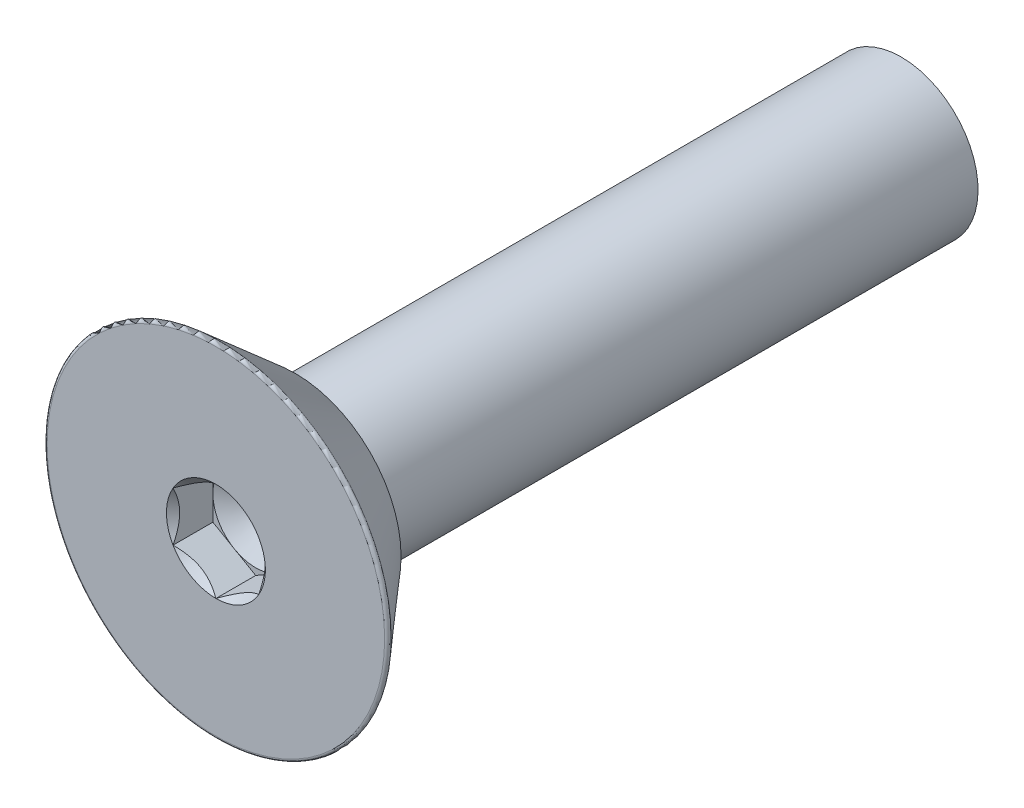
ISO-10303-21;
HEADER;
FILE_DESCRIPTION(('STEP AP214'),'2;1');
FILE_NAME('part.step','',(''),(''),'','','');
FILE_SCHEMA(('AUTOMOTIVE_DESIGN { 1 0 10303 214 1 1 1 1 }'));
ENDSEC;
DATA;
#1=APPLICATION_CONTEXT('core data for automotive mechanical design processes');
#2=APPLICATION_PROTOCOL_DEFINITION('international standard','automotive_design',2000,#1);
#3=PRODUCT_CONTEXT('',#1,'mechanical');
#4=PRODUCT('Part','Part','',(#3));
#5=PRODUCT_RELATED_PRODUCT_CATEGORY('part','',(#4));
#6=PRODUCT_DEFINITION_FORMATION('','',#4);
#7=PRODUCT_DEFINITION_CONTEXT('part definition',#1,'design');
#8=PRODUCT_DEFINITION('design','',#6,#7);
#9=PRODUCT_DEFINITION_SHAPE('','',#8);
#10=(LENGTH_UNIT() NAMED_UNIT(*) SI_UNIT(.MILLI.,.METRE.));
#11=(NAMED_UNIT(*) PLANE_ANGLE_UNIT() SI_UNIT($,.RADIAN.));
#12=(NAMED_UNIT(*) SI_UNIT($,.STERADIAN.) SOLID_ANGLE_UNIT());
#13=UNCERTAINTY_MEASURE_WITH_UNIT(LENGTH_MEASURE(1.E-05),#10,'distance_accuracy_value','');
#14=(GEOMETRIC_REPRESENTATION_CONTEXT(3) GLOBAL_UNCERTAINTY_ASSIGNED_CONTEXT((#13)) GLOBAL_UNIT_ASSIGNED_CONTEXT((#10,
#11,#12)) REPRESENTATION_CONTEXT('',''));
#15=CARTESIAN_POINT('',(0.,0.,0.));
#16=DIRECTION('',(0.,0.,1.));
#17=DIRECTION('',(1.,0.,0.));
#18=AXIS2_PLACEMENT_3D('',#15,#16,#17);
#19=CARTESIAN_POINT('',(0.,-0.916543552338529,0.73787));
#20=DIRECTION('',(0.,0.,1.));
#21=DIRECTION('',(1.,0.,0.));
#22=AXIS2_PLACEMENT_3D('',#19,#20,#21);
#23=PLANE('',#22);
#24=CARTESIAN_POINT('',(0.,0.,0.73787));
#25=DIRECTION('',(0.,0.,1.));
#26=DIRECTION('',(1.,0.,0.));
#27=AXIS2_PLACEMENT_3D('',#24,#25,#26);
#28=CIRCLE('',#27,0.79375);
#29=CARTESIAN_POINT('',(0.79375,0.,0.73787));
#30=VERTEX_POINT('',#29);
#31=CARTESIAN_POINT('',(0.396875,0.687407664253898,0.73787));
#32=VERTEX_POINT('',#31);
#33=EDGE_CURVE('E45',#30,#32,#28,.T.);
#34=ORIENTED_EDGE('',*,*,#33,.F.);
#35=DIRECTION('',(0.,1.,0.));
#36=VECTOR('',#35,1.);
#37=CARTESIAN_POINT('',(0.79375,-0.458271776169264,0.73787));
#38=LINE('',#37,#36);
#39=CARTESIAN_POINT('',(0.79375,0.458271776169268,0.73787));
#40=VERTEX_POINT('',#39);
#41=EDGE_CURVE('E115',#30,#40,#38,.T.);
#42=ORIENTED_EDGE('',*,*,#41,.T.);
#43=DIRECTION('',(-0.866025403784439,0.5,0.));
#44=VECTOR('',#43,1.);
#45=CARTESIAN_POINT('',(0.79375,0.458271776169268,0.73787));
#46=LINE('',#45,#44);
#47=EDGE_CURVE('E118',#40,#32,#46,.T.);
#48=ORIENTED_EDGE('',*,*,#47,.T.);
#49=EDGE_LOOP('',(#34,#42,#48));
#50=FACE_BOUND('',#49,.T.);
#51=ADVANCED_FACE('F34',(#50),#23,.T.);
#52=CARTESIAN_POINT('',(-0.396875,0.687407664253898,0.73787));
#53=VERTEX_POINT('',#52);
#54=EDGE_CURVE('E11',#32,#53,#28,.T.);
#55=ORIENTED_EDGE('',*,*,#54,.F.);
#56=CARTESIAN_POINT('',(0.,0.916543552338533,0.73787));
#57=VERTEX_POINT('',#56);
#58=EDGE_CURVE('E132',#32,#57,#46,.T.);
#59=ORIENTED_EDGE('',*,*,#58,.T.);
#60=DIRECTION('',(-0.866025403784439,-0.5,0.));
#61=VECTOR('',#60,1.);
#62=CARTESIAN_POINT('',(0.,0.916543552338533,0.73787));
#63=LINE('',#62,#61);
#64=EDGE_CURVE('E138',#57,#53,#63,.T.);
#65=ORIENTED_EDGE('',*,*,#64,.T.);
#66=EDGE_LOOP('',(#55,#59,#65));
#67=FACE_BOUND('',#66,.T.);
#68=ADVANCED_FACE('F192',(#67),#23,.T.);
#69=CARTESIAN_POINT('',(-0.79375,0.,0.73787));
#70=VERTEX_POINT('',#69);
#71=EDGE_CURVE('E43',#53,#70,#28,.T.);
#72=ORIENTED_EDGE('',*,*,#71,.F.);
#73=CARTESIAN_POINT('',(-0.79375,0.458271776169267,0.73787));
#74=VERTEX_POINT('',#73);
#75=EDGE_CURVE('E137',#53,#74,#63,.T.);
#76=ORIENTED_EDGE('',*,*,#75,.T.);
#77=DIRECTION('',(0.,-1.,0.));
#78=VECTOR('',#77,1.);
#79=CARTESIAN_POINT('',(-0.79375,0.458271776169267,0.73787));
#80=LINE('',#79,#78);
#81=EDGE_CURVE('E142',#74,#70,#80,.T.);
#82=ORIENTED_EDGE('',*,*,#81,.T.);
#83=EDGE_LOOP('',(#72,#76,#82));
#84=FACE_BOUND('',#83,.T.);
#85=ADVANCED_FACE('F197',(#84),#23,.T.);
#86=CARTESIAN_POINT('',(-0.396875,-0.687407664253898,0.73787));
#87=VERTEX_POINT('',#86);
#88=EDGE_CURVE('E227',#70,#87,#28,.T.);
#89=ORIENTED_EDGE('',*,*,#88,.F.);
#90=CARTESIAN_POINT('',(-0.79375,-0.458271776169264,0.73787));
#91=VERTEX_POINT('',#90);
#92=EDGE_CURVE('E141',#70,#91,#80,.T.);
#93=ORIENTED_EDGE('',*,*,#92,.T.);
#94=DIRECTION('',(0.866025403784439,-0.5,0.));
#95=VECTOR('',#94,1.);
#96=CARTESIAN_POINT('',(-0.79375,-0.458271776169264,0.73787));
#97=LINE('',#96,#95);
#98=EDGE_CURVE('E232',#91,#87,#97,.T.);
#99=ORIENTED_EDGE('',*,*,#98,.T.);
#100=EDGE_LOOP('',(#89,#93,#99));
#101=FACE_BOUND('',#100,.T.);
#102=ADVANCED_FACE('F213',(#101),#23,.T.);
#103=CARTESIAN_POINT('',(0.396874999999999,-0.687407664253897,0.73787));
#104=VERTEX_POINT('',#103);
#105=EDGE_CURVE('E52',#87,#104,#28,.T.);
#106=ORIENTED_EDGE('',*,*,#105,.F.);
#107=CARTESIAN_POINT('',(0.,-0.916543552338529,0.73787));
#108=VERTEX_POINT('',#107);
#109=EDGE_CURVE('E224',#87,#108,#97,.T.);
#110=ORIENTED_EDGE('',*,*,#109,.T.);
#111=DIRECTION('',(0.866025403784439,0.5,0.));
#112=VECTOR('',#111,1.);
#113=CARTESIAN_POINT('',(0.,-0.916543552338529,0.73787));
#114=LINE('',#113,#112);
#115=EDGE_CURVE('E127',#108,#104,#114,.T.);
#116=ORIENTED_EDGE('',*,*,#115,.T.);
#117=EDGE_LOOP('',(#106,#110,#116));
#118=FACE_BOUND('',#117,.T.);
#119=ADVANCED_FACE('F202',(#118),#23,.T.);
#120=CARTESIAN_POINT('',(0.,0.,0.));
#121=DIRECTION('',(0.,0.,-1.));
#122=DIRECTION('',(0.,1.,0.));
#123=AXIS2_PLACEMENT_3D('',#120,#121,#122);
#124=CYLINDRICAL_SURFACE('',#123,1.4224);
#125=CARTESIAN_POINT('',(0.,0.,0.));
#126=DIRECTION('',(0.,0.,1.));
#127=DIRECTION('',(1.,0.,0.));
#128=AXIS2_PLACEMENT_3D('',#125,#126,#127);
#129=CIRCLE('',#128,1.4224);
#130=CARTESIAN_POINT('',(1.4224,0.,0.));
#131=VERTEX_POINT('',#130);
#132=EDGE_CURVE('E163',#131,#131,#129,.F.);
#133=ORIENTED_EDGE('',*,*,#132,.T.);
#134=EDGE_LOOP('',(#133));
#135=FACE_BOUND('',#134,.T.);
#136=CARTESIAN_POINT('',(0.,0.,-11.22426));
#137=DIRECTION('',(0.,0.,-1.));
#138=DIRECTION('',(0.,1.,0.));
#139=AXIS2_PLACEMENT_3D('',#136,#137,#138);
#140=CIRCLE('',#139,1.4224);
#141=CARTESIAN_POINT('',(0.,1.4224,-11.22426));
#142=VERTEX_POINT('',#141);
#143=EDGE_CURVE('E166',#142,#142,#140,.T.);
#144=ORIENTED_EDGE('',*,*,#143,.F.);
#145=EDGE_LOOP('',(#144));
#146=FACE_BOUND('',#145,.T.);
#147=ADVANCED_FACE('F212',(#135,#146),#124,.T.);
#148=CARTESIAN_POINT('',(0.,0.,-11.22426));
#149=DIRECTION('',(0.,0.,-1.));
#150=DIRECTION('',(0.,1.,0.));
#151=AXIS2_PLACEMENT_3D('',#148,#149,#150);
#152=PLANE('',#151);
#153=ORIENTED_EDGE('',*,*,#143,.T.);
#154=EDGE_LOOP('',(#153));
#155=FACE_BOUND('',#154,.T.);
#156=ADVANCED_FACE('F219',(#155),#152,.T.);
#157=CARTESIAN_POINT('',(0.,0.,0.));
#158=DIRECTION('',(0.,0.,1.));
#159=DIRECTION('',(1.,0.,0.));
#160=AXIS2_PLACEMENT_3D('',#157,#158,#159);
#161=PLANE('',#160);
#162=CARTESIAN_POINT('',(0.,0.,0.));
#163=DIRECTION('',(0.,0.,-1.));
#164=DIRECTION('',(0.,1.,0.));
#165=AXIS2_PLACEMENT_3D('',#162,#163,#164);
#166=CIRCLE('',#165,1.95565878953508);
#167=CARTESIAN_POINT('',(0.,1.95565878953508,0.));
#168=VERTEX_POINT('',#167);
#169=EDGE_CURVE('E149',#168,#168,#166,.T.);
#170=ORIENTED_EDGE('',*,*,#169,.T.);
#171=EDGE_LOOP('',(#170));
#172=FACE_BOUND('',#171,.T.);
#173=ORIENTED_EDGE('',*,*,#132,.F.);
#174=EDGE_LOOP('',(#173));
#175=FACE_BOUND('',#174,.T.);
#176=ADVANCED_FACE('F431',(#172,#175),#161,.F.);
#177=CARTESIAN_POINT('',(0.,0.,1.47574));
#178=DIRECTION('',(0.,0.,1.));
#179=DIRECTION('',(0.,-1.,0.));
#180=AXIS2_PLACEMENT_3D('',#177,#178,#179);
#181=CONICAL_SURFACE('',#180,3.2385,0.715584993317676);
#182=CARTESIAN_POINT('',(0.,0.,1.39161220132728));
#183=DIRECTION('',(0.,0.,1.));
#184=DIRECTION('',(0.,-1.,0.));
#185=AXIS2_PLACEMENT_3D('',#182,#183,#184);
#186=CIRCLE('',#185,3.16536882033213);
#187=CARTESIAN_POINT('',(0.,-3.16536882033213,1.39161220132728));
#188=VERTEX_POINT('',#187);
#189=EDGE_CURVE('E168',#188,#188,#186,.F.);
#190=ORIENTED_EDGE('',*,*,#189,.T.);
#191=EDGE_LOOP('',(#190));
#192=FACE_BOUND('',#191,.T.);
#193=ORIENTED_EDGE('',*,*,#169,.F.);
#194=EDGE_LOOP('',(#193));
#195=FACE_BOUND('',#194,.T.);
#196=ADVANCED_FACE('F188',(#192,#195),#181,.T.);
#197=CARTESIAN_POINT('',(0.,0.,1.47574));
#198=DIRECTION('',(0.,0.,1.));
#199=DIRECTION('',(1.,0.,0.));
#200=AXIS2_PLACEMENT_3D('',#197,#198,#199);
#201=PLANE('',#200);
#202=CARTESIAN_POINT('',(0.,0.,1.47574));
#203=DIRECTION('',(0.,0.,1.));
#204=DIRECTION('',(1.,0.,0.));
#205=AXIS2_PLACEMENT_3D('',#202,#203,#204);
#206=CIRCLE('',#205,0.916543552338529);
#207=CARTESIAN_POINT('',(0.79375,0.458271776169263,1.47574));
#208=VERTEX_POINT('',#207);
#209=CARTESIAN_POINT('',(0.,0.91654355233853,1.47574));
#210=VERTEX_POINT('',#209);
#211=EDGE_CURVE('E481',#208,#210,#206,.T.);
#212=ORIENTED_EDGE('',*,*,#211,.F.);
#213=CARTESIAN_POINT('',(0.79375,-0.458271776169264,1.47574));
#214=VERTEX_POINT('',#213);
#215=EDGE_CURVE('E476',#214,#208,#206,.T.);
#216=ORIENTED_EDGE('',*,*,#215,.F.);
#217=CARTESIAN_POINT('',(0.,-0.916543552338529,1.47574));
#218=VERTEX_POINT('',#217);
#219=EDGE_CURVE('E480',#218,#214,#206,.T.);
#220=ORIENTED_EDGE('',*,*,#219,.F.);
#221=CARTESIAN_POINT('',(-0.79375,-0.458271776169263,1.47574));
#222=VERTEX_POINT('',#221);
#223=EDGE_CURVE('E492',#222,#218,#206,.T.);
#224=ORIENTED_EDGE('',*,*,#223,.F.);
#225=CARTESIAN_POINT('',(-0.793749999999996,0.45827177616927,1.47574));
#226=VERTEX_POINT('',#225);
#227=EDGE_CURVE('E59',#226,#222,#206,.T.);
#228=ORIENTED_EDGE('',*,*,#227,.F.);
#229=EDGE_CURVE('E488',#210,#226,#206,.T.);
#230=ORIENTED_EDGE('',*,*,#229,.F.);
#231=EDGE_LOOP('',(#212,#216,#220,#224,#228,#230));
#232=FACE_BOUND('',#231,.T.);
#233=CARTESIAN_POINT('',(0.,0.,1.47574));
#234=DIRECTION('',(0.,0.,1.));
#235=DIRECTION('',(1.,0.,0.));
#236=AXIS2_PLACEMENT_3D('',#233,#234,#235);
#237=CIRCLE('',#236,3.12702957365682);
#238=CARTESIAN_POINT('',(3.12702957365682,0.,1.47574));
#239=VERTEX_POINT('',#238);
#240=EDGE_CURVE('E38',#239,#239,#237,.T.);
#241=ORIENTED_EDGE('',*,*,#240,.T.);
#242=EDGE_LOOP('',(#241));
#243=FACE_BOUND('',#242,.T.);
#244=ADVANCED_FACE('F175',(#232,#243),#201,.T.);
#245=CARTESIAN_POINT('',(0.,0.,1.42494));
#246=DIRECTION('',(0.,0.,1.));
#247=DIRECTION('',(1.,0.,0.));
#248=AXIS2_PLACEMENT_3D('',#245,#246,#247);
#249=TOROIDAL_SURFACE('',#248,3.12702957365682,0.0508);
#250=ORIENTED_EDGE('',*,*,#240,.F.);
#251=EDGE_LOOP('',(#250));
#252=FACE_BOUND('',#251,.T.);
#253=ORIENTED_EDGE('',*,*,#189,.F.);
#254=EDGE_LOOP('',(#253));
#255=FACE_BOUND('',#254,.T.);
#256=ADVANCED_FACE('F36',(#252,#255),#249,.T.);
#257=CARTESIAN_POINT('',(0.,0.,1.47574));
#258=DIRECTION('',(0.,0.,1.));
#259=DIRECTION('',(1.,0.,0.));
#260=AXIS2_PLACEMENT_3D('',#257,#258,#259);
#261=CONICAL_SURFACE('',#260,0.916543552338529,0.78539816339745);
#262=ORIENTED_EDGE('',*,*,#219,.T.);
#263=CARTESIAN_POINT('',(-0.000200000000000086,-0.916659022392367,1.4758554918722));
#264=CARTESIAN_POINT('',(0.0270936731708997,-0.900901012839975,1.46010677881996));
#265=CARTESIAN_POINT('',(0.0548437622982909,-0.884879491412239,1.44528254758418));
#266=CARTESIAN_POINT('',(0.11142974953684,-0.852209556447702,1.41813903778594));
#267=CARTESIAN_POINT('',(0.140271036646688,-0.835558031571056,1.40583487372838));
#268=CARTESIAN_POINT('',(0.198428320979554,-0.801980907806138,1.3847573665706));
#269=CARTESIAN_POINT('',(0.227729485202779,-0.78506387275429,1.37593100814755));
#270=CARTESIAN_POINT('',(0.286976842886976,-0.750857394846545,1.36233123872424));
#271=CARTESIAN_POINT('',(0.316921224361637,-0.733568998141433,1.35754766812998));
#272=CARTESIAN_POINT('',(0.368524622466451,-0.703775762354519,1.35323340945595));
#273=CARTESIAN_POINT('',(0.390116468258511,-0.691309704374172,1.35259527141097));
#274=CARTESIAN_POINT('',(0.433258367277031,-0.666401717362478,1.35366613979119));
#275=CARTESIAN_POINT('',(0.454808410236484,-0.65395979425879,1.35537566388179));
#276=CARTESIAN_POINT('',(0.519150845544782,-0.616811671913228,1.36391279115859));
#277=CARTESIAN_POINT('',(0.561623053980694,-0.592290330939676,1.37414991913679));
#278=CARTESIAN_POINT('',(0.63617439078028,-0.549248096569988,1.39885858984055));
#279=CARTESIAN_POINT('',(0.668602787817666,-0.530525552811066,1.41203617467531));
#280=CARTESIAN_POINT('',(0.732189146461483,-0.49381395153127,1.44172103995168));
#281=CARTESIAN_POINT('',(0.763350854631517,-0.475822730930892,1.45821748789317));
#282=CARTESIAN_POINT('',(0.79395,-0.458156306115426,1.4758554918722));
#283=B_SPLINE_CURVE_WITH_KNOTS('',3,(#263,#264,#265,#266,#267,#268,#269,#270,#271,#272,#273,
#274,#275,#276,#277,#278,#279,#280,#281,#282),.UNSPECIFIED.,.F.,.F.,(4,2,2,2,2,2,2,2,2,4),(0.,
0.105768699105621,0.212154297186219,0.316848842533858,0.421279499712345,0.495991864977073,
0.570720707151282,0.720221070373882,0.839150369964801,0.957697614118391),.UNSPECIFIED.);
#284=EDGE_CURVE('E257',#218,#214,#283,.T.);
#285=ORIENTED_EDGE('',*,*,#284,.F.);
#286=EDGE_LOOP('',(#262,#285));
#287=FACE_BOUND('',#286,.T.);
#288=ADVANCED_FACE('F179',(#287),#261,.F.);
#289=ORIENTED_EDGE('',*,*,#215,.T.);
#290=CARTESIAN_POINT('',(0.79375,-0.931659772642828,1.78313639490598));
#291=CARTESIAN_POINT('',(0.79375,-0.909052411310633,1.76593033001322));
#292=CARTESIAN_POINT('',(0.79375,-0.886321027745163,1.74888770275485));
#293=CARTESIAN_POINT('',(0.79375,-0.840559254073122,1.71519736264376));
#294=CARTESIAN_POINT('',(0.79375,-0.817528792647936,1.69854974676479));
#295=CARTESIAN_POINT('',(0.79375,-0.747575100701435,1.64906371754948));
#296=CARTESIAN_POINT('',(0.79375,-0.700132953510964,1.61694681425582));
#297=CARTESIAN_POINT('',(0.79375,-0.600532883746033,1.55373311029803));
#298=CARTESIAN_POINT('',(0.79375,-0.548262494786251,1.52281156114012));
#299=CARTESIAN_POINT('',(0.79375,-0.441088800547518,1.46613531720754));
#300=CARTESIAN_POINT('',(0.79375,-0.386195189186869,1.44036318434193));
#301=CARTESIAN_POINT('',(0.79375,-0.303966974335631,1.40882822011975));
#302=CARTESIAN_POINT('',(0.79375,-0.277887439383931,1.3998077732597));
#303=CARTESIAN_POINT('',(0.79375,-0.225083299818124,1.38385861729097));
#304=CARTESIAN_POINT('',(0.79375,-0.198358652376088,1.37693004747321));
#305=CARTESIAN_POINT('',(0.79375,-0.144883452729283,1.36564606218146));
#306=CARTESIAN_POINT('',(0.79375,-0.118142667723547,1.36124509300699));
#307=CARTESIAN_POINT('',(0.79375,-0.064346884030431,1.35510233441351));
#308=CARTESIAN_POINT('',(0.79375,-0.0372918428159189,1.35336090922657));
#309=CARTESIAN_POINT('',(0.79375,0.015786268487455,1.35267729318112));
#310=CARTESIAN_POINT('',(0.79375,0.041807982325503,1.35362747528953));
#311=CARTESIAN_POINT('',(0.79375,0.093639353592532,1.35803320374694));
#312=CARTESIAN_POINT('',(0.79375,0.119448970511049,1.36148921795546));
#313=CARTESIAN_POINT('',(0.79375,0.171102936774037,1.37077369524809));
#314=CARTESIAN_POINT('',(0.79375,0.196939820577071,1.37664305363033));
#315=CARTESIAN_POINT('',(0.79375,0.248046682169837,1.39043696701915));
#316=CARTESIAN_POINT('',(0.79375,0.273316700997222,1.39836137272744));
#317=CARTESIAN_POINT('',(0.79375,0.352088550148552,1.42606564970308));
#318=CARTESIAN_POINT('',(0.79375,0.404489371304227,1.44896767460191));
#319=CARTESIAN_POINT('',(0.79375,0.506836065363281,1.49990882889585));
#320=CARTESIAN_POINT('',(0.79375,0.55677236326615,1.5279662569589));
#321=CARTESIAN_POINT('',(0.79375,0.652218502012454,1.5858741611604));
#322=CARTESIAN_POINT('',(0.79375,0.697825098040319,1.61556715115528));
#323=CARTESIAN_POINT('',(0.79375,0.765016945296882,1.66147936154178));
#324=CARTESIAN_POINT('',(0.79375,0.787124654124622,1.67694724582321));
#325=CARTESIAN_POINT('',(0.79375,0.8310374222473,1.70829473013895));
#326=CARTESIAN_POINT('',(0.79375,0.852842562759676,1.72417421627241));
#327=CARTESIAN_POINT('',(0.79375,0.874521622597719,1.74022444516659));
#328=B_SPLINE_CURVE_WITH_KNOTS('',3,(#290,#291,#292,#293,#294,#295,#296,#297,#298,#299,#300,
#301,#302,#303,#304,#305,#306,#307,#308,#309,#310,#311,#312,#313,#314,#315,#316,#317,#318,#319,
#320,#321,#322,#323,#324,#325,#326,#327),.UNSPECIFIED.,.F.,.F.,(4,2,2,2,2,2,2,2,2,2,2,2,2,2,2,2,
2,2,4),(0.,0.0852285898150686,0.170477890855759,0.342276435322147,0.524327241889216,
0.705750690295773,0.788467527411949,0.871189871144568,0.952370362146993,1.03356197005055,
1.111553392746,1.18955938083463,1.26894557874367,1.34832601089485,1.51938534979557,
1.69106400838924,1.85424522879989,1.93518686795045,2.01610634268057),.UNSPECIFIED.);
#329=EDGE_CURVE('E265',#214,#208,#328,.T.);
#330=ORIENTED_EDGE('',*,*,#329,.F.);
#331=EDGE_LOOP('',(#289,#330));
#332=FACE_BOUND('',#331,.T.);
#333=ADVANCED_FACE('F184',(#332),#261,.F.);
#334=ORIENTED_EDGE('',*,*,#211,.T.);
#335=CARTESIAN_POINT('',(0.793949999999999,0.45815630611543,1.4758554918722));
#336=CARTESIAN_POINT('',(0.7666563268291,0.473914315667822,1.46010677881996));
#337=CARTESIAN_POINT('',(0.738906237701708,0.489935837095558,1.44528254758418));
#338=CARTESIAN_POINT('',(0.68232025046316,0.522605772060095,1.41813903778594));
#339=CARTESIAN_POINT('',(0.653478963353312,0.539257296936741,1.40583487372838));
#340=CARTESIAN_POINT('',(0.595321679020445,0.572834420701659,1.3847573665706));
#341=CARTESIAN_POINT('',(0.56602051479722,0.589751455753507,1.37593100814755));
#342=CARTESIAN_POINT('',(0.506773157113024,0.623957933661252,1.36233123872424));
#343=CARTESIAN_POINT('',(0.476828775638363,0.641246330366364,1.35754766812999));
#344=CARTESIAN_POINT('',(0.425225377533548,0.671039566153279,1.35323340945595));
#345=CARTESIAN_POINT('',(0.403633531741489,0.683505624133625,1.35259527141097));
#346=CARTESIAN_POINT('',(0.360491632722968,0.708413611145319,1.3536661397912));
#347=CARTESIAN_POINT('',(0.338941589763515,0.720855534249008,1.35537566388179));
#348=CARTESIAN_POINT('',(0.274599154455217,0.75800365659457,1.3639127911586));
#349=CARTESIAN_POINT('',(0.232126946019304,0.782524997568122,1.3741499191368));
#350=CARTESIAN_POINT('',(0.157575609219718,0.825567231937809,1.39885858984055));
#351=CARTESIAN_POINT('',(0.125147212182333,0.844289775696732,1.41203617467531));
#352=CARTESIAN_POINT('',(0.0615608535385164,0.881001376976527,1.44172103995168));
#353=CARTESIAN_POINT('',(0.0303991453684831,0.898992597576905,1.45821748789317));
#354=CARTESIAN_POINT('',(-0.000199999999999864,0.916659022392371,1.4758554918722));
#355=B_SPLINE_CURVE_WITH_KNOTS('',3,(#335,#336,#337,#338,#339,#340,#341,#342,#343,#344,#345,
#346,#347,#348,#349,#350,#351,#352,#353,#354),.UNSPECIFIED.,.F.,.F.,(4,2,2,2,2,2,2,2,2,4),(0.,
0.105768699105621,0.212154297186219,0.316848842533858,0.421279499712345,0.495991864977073,
0.570720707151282,0.720221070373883,0.839150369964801,0.95769761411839),.UNSPECIFIED.);
#356=EDGE_CURVE('E272',#208,#210,#355,.T.);
#357=ORIENTED_EDGE('',*,*,#356,.F.);
#358=EDGE_LOOP('',(#334,#357));
#359=FACE_BOUND('',#358,.T.);
#360=ADVANCED_FACE('F381',(#359),#261,.F.);
#361=ORIENTED_EDGE('',*,*,#229,.T.);
#362=CARTESIAN_POINT('',(0.000200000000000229,0.916659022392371,1.4758554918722));
#363=CARTESIAN_POINT('',(-0.0270936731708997,0.900901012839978,1.46010677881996));
#364=CARTESIAN_POINT('',(-0.0548437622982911,0.884879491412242,1.44528254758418));
#365=CARTESIAN_POINT('',(-0.11142974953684,0.852209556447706,1.41813903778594));
#366=CARTESIAN_POINT('',(-0.140271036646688,0.835558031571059,1.40583487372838));
#367=CARTESIAN_POINT('',(-0.198428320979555,0.801980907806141,1.3847573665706));
#368=CARTESIAN_POINT('',(-0.22772948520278,0.785063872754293,1.37593100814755));
#369=CARTESIAN_POINT('',(-0.286976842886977,0.750857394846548,1.36233123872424));
#370=CARTESIAN_POINT('',(-0.316921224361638,0.733568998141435,1.35754766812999));
#371=CARTESIAN_POINT('',(-0.368524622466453,0.703775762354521,1.35323340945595));
#372=CARTESIAN_POINT('',(-0.390116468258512,0.691309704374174,1.35259527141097));
#373=CARTESIAN_POINT('',(-0.433258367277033,0.66640171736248,1.3536661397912));
#374=CARTESIAN_POINT('',(-0.454808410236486,0.653959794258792,1.35537566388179));
#375=CARTESIAN_POINT('',(-0.519150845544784,0.61681167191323,1.3639127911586));
#376=CARTESIAN_POINT('',(-0.561623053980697,0.592290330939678,1.3741499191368));
#377=CARTESIAN_POINT('',(-0.636174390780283,0.54924809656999,1.39885858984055));
#378=CARTESIAN_POINT('',(-0.668602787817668,0.530525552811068,1.41203617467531));
#379=CARTESIAN_POINT('',(-0.732189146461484,0.493813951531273,1.44172103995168));
#380=CARTESIAN_POINT('',(-0.763350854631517,0.475822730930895,1.45821748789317));
#381=CARTESIAN_POINT('',(-0.79395,0.458156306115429,1.4758554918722));
#382=B_SPLINE_CURVE_WITH_KNOTS('',3,(#362,#363,#364,#365,#366,#367,#368,#369,#370,#371,#372,
#373,#374,#375,#376,#377,#378,#379,#380,#381),.UNSPECIFIED.,.F.,.F.,(4,2,2,2,2,2,2,2,2,4),(0.,
0.105768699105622,0.21215429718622,0.31684884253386,0.421279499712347,0.495991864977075,
0.570720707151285,0.720221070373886,0.839150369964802,0.957697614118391),.UNSPECIFIED.);
#383=EDGE_CURVE('E277',#210,#226,#382,.T.);
#384=ORIENTED_EDGE('',*,*,#383,.F.);
#385=EDGE_LOOP('',(#361,#384));
#386=FACE_BOUND('',#385,.T.);
#387=ADVANCED_FACE('F374',(#386),#261,.F.);
#388=ORIENTED_EDGE('',*,*,#227,.T.);
#389=CARTESIAN_POINT('',(-0.79375,-0.931659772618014,1.78313639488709));
#390=CARTESIAN_POINT('',(-0.79375,-0.909052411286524,1.76593032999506));
#391=CARTESIAN_POINT('',(-0.79375,-0.886321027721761,1.74888770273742));
#392=CARTESIAN_POINT('',(-0.79375,-0.840559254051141,1.71519736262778));
#393=CARTESIAN_POINT('',(-0.79375,-0.817528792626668,1.69854974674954));
#394=CARTESIAN_POINT('',(-0.79375,-0.747575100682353,1.64906371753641));
#395=CARTESIAN_POINT('',(-0.79375,-0.700132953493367,1.6169468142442));
#396=CARTESIAN_POINT('',(-0.79375,-0.600532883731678,1.5537331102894));
#397=CARTESIAN_POINT('',(-0.79375,-0.548262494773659,1.52281156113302));
#398=CARTESIAN_POINT('',(-0.79375,-0.441088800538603,1.46613531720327));
#399=CARTESIAN_POINT('',(-0.79375,-0.386195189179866,1.44036318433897));
#400=CARTESIAN_POINT('',(-0.79375,-0.303966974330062,1.40882822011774));
#401=CARTESIAN_POINT('',(-0.79375,-0.277887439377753,1.39980777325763));
#402=CARTESIAN_POINT('',(-0.79375,-0.225083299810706,1.38385861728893));
#403=CARTESIAN_POINT('',(-0.79375,-0.19835865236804,1.37693004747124));
#404=CARTESIAN_POINT('',(-0.79375,-0.144883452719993,1.36564606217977));
#405=CARTESIAN_POINT('',(-0.79375,-0.118142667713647,1.36124509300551));
#406=CARTESIAN_POINT('',(-0.79375,-0.0643468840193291,1.3551023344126));
#407=CARTESIAN_POINT('',(-0.79375,-0.0372918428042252,1.35336090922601));
#408=CARTESIAN_POINT('',(-0.79375,0.0157862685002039,1.35267729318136));
#409=CARTESIAN_POINT('',(-0.79375,0.0418079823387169,1.35362747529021));
#410=CARTESIAN_POINT('',(-0.79375,0.0936393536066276,1.35803320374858));
#411=CARTESIAN_POINT('',(-0.79375,0.119448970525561,1.36148921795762));
#412=CARTESIAN_POINT('',(-0.79375,0.171102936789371,1.37077369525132));
#413=CARTESIAN_POINT('',(-0.79375,0.19693982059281,1.37664305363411));
#414=CARTESIAN_POINT('',(-0.79375,0.248046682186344,1.39043696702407));
#415=CARTESIAN_POINT('',(-0.79375,0.273316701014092,1.39836137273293));
#416=CARTESIAN_POINT('',(-0.79375,0.352088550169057,1.42606564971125));
#417=CARTESIAN_POINT('',(-0.79375,0.404489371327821,1.44896767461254));
#418=CARTESIAN_POINT('',(-0.79375,0.506836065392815,1.49990882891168));
#419=CARTESIAN_POINT('',(-0.79375,0.556772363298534,1.52796625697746));
#420=CARTESIAN_POINT('',(-0.79375,0.652218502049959,1.58587416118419));
#421=CARTESIAN_POINT('',(-0.79375,0.697825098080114,1.61556715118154));
#422=CARTESIAN_POINT('',(-0.79375,0.765016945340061,1.66147936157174));
#423=CARTESIAN_POINT('',(-0.79375,0.787124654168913,1.67694724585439));
#424=CARTESIAN_POINT('',(-0.79375,0.831037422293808,1.70829473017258));
#425=CARTESIAN_POINT('',(-0.79375,0.852842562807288,1.72417421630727));
#426=CARTESIAN_POINT('',(-0.79375,0.874521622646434,1.74022444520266));
#427=B_SPLINE_CURVE_WITH_KNOTS('',3,(#389,#390,#391,#392,#393,#394,#395,#396,#397,#398,#399,
#400,#401,#402,#403,#404,#405,#406,#407,#408,#409,#410,#411,#412,#413,#414,#415,#416,#417,#418,
#419,#420,#421,#422,#423,#424,#425,#426),.UNSPECIFIED.,.F.,.F.,(4,2,2,2,2,2,2,2,2,2,2,2,2,2,2,2,
2,2,4),(0.,0.085228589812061,0.170477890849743,0.342276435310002,0.524327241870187,
0.705750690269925,0.788467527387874,0.871189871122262,0.95237036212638,1.03356197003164,
1.11155339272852,1.18955938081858,1.26894557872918,1.34832601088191,1.51938534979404,
1.69106400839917,1.85424522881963,1.93518686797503,2.01610634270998),.UNSPECIFIED.);
#428=EDGE_CURVE('E244',#226,#222,#427,.F.);
#429=ORIENTED_EDGE('',*,*,#428,.F.);
#430=EDGE_LOOP('',(#388,#429));
#431=FACE_BOUND('',#430,.T.);
#432=ADVANCED_FACE('F209',(#431),#261,.F.);
#433=ORIENTED_EDGE('',*,*,#223,.T.);
#434=CARTESIAN_POINT('',(-0.79395,-0.458156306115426,1.4758554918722));
#435=CARTESIAN_POINT('',(-0.7666563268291,-0.473914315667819,1.46010677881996));
#436=CARTESIAN_POINT('',(-0.738906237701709,-0.489935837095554,1.44528254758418));
#437=CARTESIAN_POINT('',(-0.68232025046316,-0.522605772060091,1.41813903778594));
#438=CARTESIAN_POINT('',(-0.653478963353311,-0.539257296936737,1.40583487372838));
#439=CARTESIAN_POINT('',(-0.595321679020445,-0.572834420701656,1.3847573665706));
#440=CARTESIAN_POINT('',(-0.56602051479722,-0.589751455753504,1.37593100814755));
#441=CARTESIAN_POINT('',(-0.506773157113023,-0.623957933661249,1.36233123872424));
#442=CARTESIAN_POINT('',(-0.476828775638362,-0.641246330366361,1.35754766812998));
#443=CARTESIAN_POINT('',(-0.425225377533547,-0.671039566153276,1.35323340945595));
#444=CARTESIAN_POINT('',(-0.403633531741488,-0.683505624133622,1.35259527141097));
#445=CARTESIAN_POINT('',(-0.360491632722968,-0.708413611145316,1.35366613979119));
#446=CARTESIAN_POINT('',(-0.338941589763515,-0.720855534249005,1.35537566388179));
#447=CARTESIAN_POINT('',(-0.274599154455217,-0.758003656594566,1.36391279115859));
#448=CARTESIAN_POINT('',(-0.232126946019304,-0.782524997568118,1.37414991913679));
#449=CARTESIAN_POINT('',(-0.157575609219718,-0.825567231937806,1.39885858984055));
#450=CARTESIAN_POINT('',(-0.125147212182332,-0.844289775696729,1.41203617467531));
#451=CARTESIAN_POINT('',(-0.0615608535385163,-0.881001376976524,1.44172103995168));
#452=CARTESIAN_POINT('',(-0.0303991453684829,-0.898992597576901,1.45821748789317));
#453=CARTESIAN_POINT('',(0.000200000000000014,-0.916659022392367,1.4758554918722));
#454=B_SPLINE_CURVE_WITH_KNOTS('',3,(#434,#435,#436,#437,#438,#439,#440,#441,#442,#443,#444,
#445,#446,#447,#448,#449,#450,#451,#452,#453),.UNSPECIFIED.,.F.,.F.,(4,2,2,2,2,2,2,2,2,4),(0.,
0.105768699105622,0.212154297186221,0.31684884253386,0.421279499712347,0.495991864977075,
0.570720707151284,0.720221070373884,0.839150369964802,0.957697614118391),.UNSPECIFIED.);
#455=EDGE_CURVE('E234',#222,#218,#454,.T.);
#456=ORIENTED_EDGE('',*,*,#455,.F.);
#457=EDGE_LOOP('',(#433,#456));
#458=FACE_BOUND('',#457,.T.);
#459=ADVANCED_FACE('F187',(#458),#261,.F.);
#460=EDGE_CURVE('E105',#104,#30,#28,.T.);
#461=ORIENTED_EDGE('',*,*,#460,.F.);
#462=CARTESIAN_POINT('',(0.79375,-0.458271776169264,0.73787));
#463=VERTEX_POINT('',#462);
#464=EDGE_CURVE('E130',#104,#463,#114,.T.);
#465=ORIENTED_EDGE('',*,*,#464,.T.);
#466=EDGE_CURVE('E123',#463,#30,#38,.T.);
#467=ORIENTED_EDGE('',*,*,#466,.T.);
#468=EDGE_LOOP('',(#461,#465,#467));
#469=FACE_BOUND('',#468,.T.);
#470=ADVANCED_FACE('F129',(#469),#23,.T.);
#471=CARTESIAN_POINT('',(0.,-0.916543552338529,0.73787));
#472=DIRECTION('',(0.5,-0.866025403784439,0.));
#473=DIRECTION('',(0.866025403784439,0.5,0.));
#474=AXIS2_PLACEMENT_3D('',#471,#472,#473);
#475=PLANE('',#474);
#476=DIRECTION('',(0.,0.,1.));
#477=VECTOR('',#476,1.);
#478=CARTESIAN_POINT('',(0.,-0.916543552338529,0.73787));
#479=LINE('',#478,#477);
#480=EDGE_CURVE('E145',#108,#218,#479,.T.);
#481=ORIENTED_EDGE('',*,*,#480,.T.);
#482=ORIENTED_EDGE('',*,*,#284,.T.);
#483=DIRECTION('',(0.,0.,1.));
#484=VECTOR('',#483,1.);
#485=CARTESIAN_POINT('',(0.79375,-0.458271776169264,0.73787));
#486=LINE('',#485,#484);
#487=EDGE_CURVE('E157',#463,#214,#486,.T.);
#488=ORIENTED_EDGE('',*,*,#487,.F.);
#489=ORIENTED_EDGE('',*,*,#464,.F.);
#490=ORIENTED_EDGE('',*,*,#115,.F.);
#491=EDGE_LOOP('',(#481,#482,#488,#489,#490));
#492=FACE_BOUND('',#491,.T.);
#493=ADVANCED_FACE('F201',(#492),#475,.F.);
#494=CARTESIAN_POINT('',(0.79375,-0.458271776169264,0.73787));
#495=DIRECTION('',(1.,0.,0.));
#496=DIRECTION('',(0.,1.,0.));
#497=AXIS2_PLACEMENT_3D('',#494,#495,#496);
#498=PLANE('',#497);
#499=ORIENTED_EDGE('',*,*,#487,.T.);
#500=ORIENTED_EDGE('',*,*,#329,.T.);
#501=DIRECTION('',(0.,0.,1.));
#502=VECTOR('',#501,1.);
#503=CARTESIAN_POINT('',(0.79375,0.458271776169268,0.73787));
#504=LINE('',#503,#502);
#505=EDGE_CURVE('E126',#40,#208,#504,.T.);
#506=ORIENTED_EDGE('',*,*,#505,.F.);
#507=ORIENTED_EDGE('',*,*,#41,.F.);
#508=ORIENTED_EDGE('',*,*,#466,.F.);
#509=EDGE_LOOP('',(#499,#500,#506,#507,#508));
#510=FACE_BOUND('',#509,.T.);
#511=ADVANCED_FACE('F122',(#510),#498,.F.);
#512=CARTESIAN_POINT('',(0.79375,0.458271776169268,0.73787));
#513=DIRECTION('',(0.5,0.866025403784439,0.));
#514=DIRECTION('',(-0.866025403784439,0.5,0.));
#515=AXIS2_PLACEMENT_3D('',#512,#513,#514);
#516=PLANE('',#515);
#517=ORIENTED_EDGE('',*,*,#505,.T.);
#518=ORIENTED_EDGE('',*,*,#356,.T.);
#519=DIRECTION('',(0.,0.,1.));
#520=VECTOR('',#519,1.);
#521=CARTESIAN_POINT('',(0.,0.916543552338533,0.73787));
#522=LINE('',#521,#520);
#523=EDGE_CURVE('E153',#57,#210,#522,.T.);
#524=ORIENTED_EDGE('',*,*,#523,.F.);
#525=ORIENTED_EDGE('',*,*,#58,.F.);
#526=ORIENTED_EDGE('',*,*,#47,.F.);
#527=EDGE_LOOP('',(#517,#518,#524,#525,#526));
#528=FACE_BOUND('',#527,.T.);
#529=ADVANCED_FACE('F287',(#528),#516,.F.);
#530=CARTESIAN_POINT('',(0.,0.916543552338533,0.73787));
#531=DIRECTION('',(-0.5,0.866025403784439,0.));
#532=DIRECTION('',(-0.866025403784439,-0.5,0.));
#533=AXIS2_PLACEMENT_3D('',#530,#531,#532);
#534=PLANE('',#533);
#535=ORIENTED_EDGE('',*,*,#523,.T.);
#536=ORIENTED_EDGE('',*,*,#383,.T.);
#537=DIRECTION('',(0.,0.,1.));
#538=VECTOR('',#537,1.);
#539=CARTESIAN_POINT('',(-0.79375,0.458271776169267,0.73787));
#540=LINE('',#539,#538);
#541=EDGE_CURVE('E150',#74,#226,#540,.T.);
#542=ORIENTED_EDGE('',*,*,#541,.F.);
#543=ORIENTED_EDGE('',*,*,#75,.F.);
#544=ORIENTED_EDGE('',*,*,#64,.F.);
#545=EDGE_LOOP('',(#535,#536,#542,#543,#544));
#546=FACE_BOUND('',#545,.T.);
#547=ADVANCED_FACE('F283',(#546),#534,.F.);
#548=CARTESIAN_POINT('',(-0.79375,0.458271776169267,0.73787));
#549=DIRECTION('',(-1.,0.,0.));
#550=DIRECTION('',(0.,-1.,0.));
#551=AXIS2_PLACEMENT_3D('',#548,#549,#550);
#552=PLANE('',#551);
#553=ORIENTED_EDGE('',*,*,#541,.T.);
#554=ORIENTED_EDGE('',*,*,#428,.T.);
#555=DIRECTION('',(0.,0.,1.));
#556=VECTOR('',#555,1.);
#557=CARTESIAN_POINT('',(-0.79375,-0.458271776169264,0.73787));
#558=LINE('',#557,#556);
#559=EDGE_CURVE('E146',#91,#222,#558,.T.);
#560=ORIENTED_EDGE('',*,*,#559,.F.);
#561=ORIENTED_EDGE('',*,*,#92,.F.);
#562=ORIENTED_EDGE('',*,*,#81,.F.);
#563=EDGE_LOOP('',(#553,#554,#560,#561,#562));
#564=FACE_BOUND('',#563,.T.);
#565=ADVANCED_FACE('F286',(#564),#552,.F.);
#566=CARTESIAN_POINT('',(-0.79375,-0.458271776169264,0.73787));
#567=DIRECTION('',(-0.5,-0.866025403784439,0.));
#568=DIRECTION('',(0.866025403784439,-0.5,0.));
#569=AXIS2_PLACEMENT_3D('',#566,#567,#568);
#570=PLANE('',#569);
#571=ORIENTED_EDGE('',*,*,#559,.T.);
#572=ORIENTED_EDGE('',*,*,#455,.T.);
#573=ORIENTED_EDGE('',*,*,#480,.F.);
#574=ORIENTED_EDGE('',*,*,#109,.F.);
#575=ORIENTED_EDGE('',*,*,#98,.F.);
#576=EDGE_LOOP('',(#571,#572,#573,#574,#575));
#577=FACE_BOUND('',#576,.T.);
#578=ADVANCED_FACE('F231',(#577),#570,.F.);
#579=CARTESIAN_POINT('',(0.,0.,0.73787));
#580=DIRECTION('',(0.,0.,1.));
#581=DIRECTION('',(1.,0.,0.));
#582=AXIS2_PLACEMENT_3D('',#579,#580,#581);
#583=CONICAL_SURFACE('',#582,0.79375,1.0471975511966);
#584=CARTESIAN_POINT('',(0.,0.,0.491913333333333));
#585=DIRECTION('',(0.,0.,1.));
#586=DIRECTION('',(1.,0.,0.));
#587=AXIS2_PLACEMENT_3D('',#584,#585,#586);
#588=CIRCLE('',#587,0.367740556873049);
#589=CARTESIAN_POINT('',(0.367740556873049,0.,0.491913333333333));
#590=VERTEX_POINT('',#589);
#591=EDGE_CURVE('E119',#590,#590,#588,.T.);
#592=ORIENTED_EDGE('',*,*,#591,.F.);
#593=EDGE_LOOP('',(#592));
#594=FACE_BOUND('',#593,.T.);
#595=ORIENTED_EDGE('',*,*,#33,.T.);
#596=ORIENTED_EDGE('',*,*,#54,.T.);
#597=ORIENTED_EDGE('',*,*,#71,.T.);
#598=ORIENTED_EDGE('',*,*,#88,.T.);
#599=ORIENTED_EDGE('',*,*,#105,.T.);
#600=ORIENTED_EDGE('',*,*,#460,.T.);
#601=EDGE_LOOP('',(#595,#596,#597,#598,#599,#600));
#602=FACE_BOUND('',#601,.T.);
#603=ADVANCED_FACE('F107',(#594,#602),#583,.F.);
#604=CARTESIAN_POINT('',(0.,0.,0.491913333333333));
#605=DIRECTION('',(0.,0.,1.));
#606=DIRECTION('',(1.,0.,0.));
#607=AXIS2_PLACEMENT_3D('',#604,#605,#606);
#608=PLANE('',#607);
#609=ORIENTED_EDGE('',*,*,#591,.T.);
#610=EDGE_LOOP('',(#609));
#611=FACE_BOUND('',#610,.T.);
#612=ADVANCED_FACE('F325',(#611),#608,.T.);
#613=CLOSED_SHELL('',(#51,#68,#85,#102,#119,#147,#156,#176,#196,#244,#256,#288,#333,#360,#387,
#432,#459,#470,#493,#511,#529,#547,#565,#578,#603,#612));
#614=MANIFOLD_SOLID_BREP('B2',#613);
#615=ADVANCED_BREP_SHAPE_REPRESENTATION('',(#18,#614),#14);
#616=SHAPE_DEFINITION_REPRESENTATION(#9,#615);
ENDSEC;
END-ISO-10303-21;
